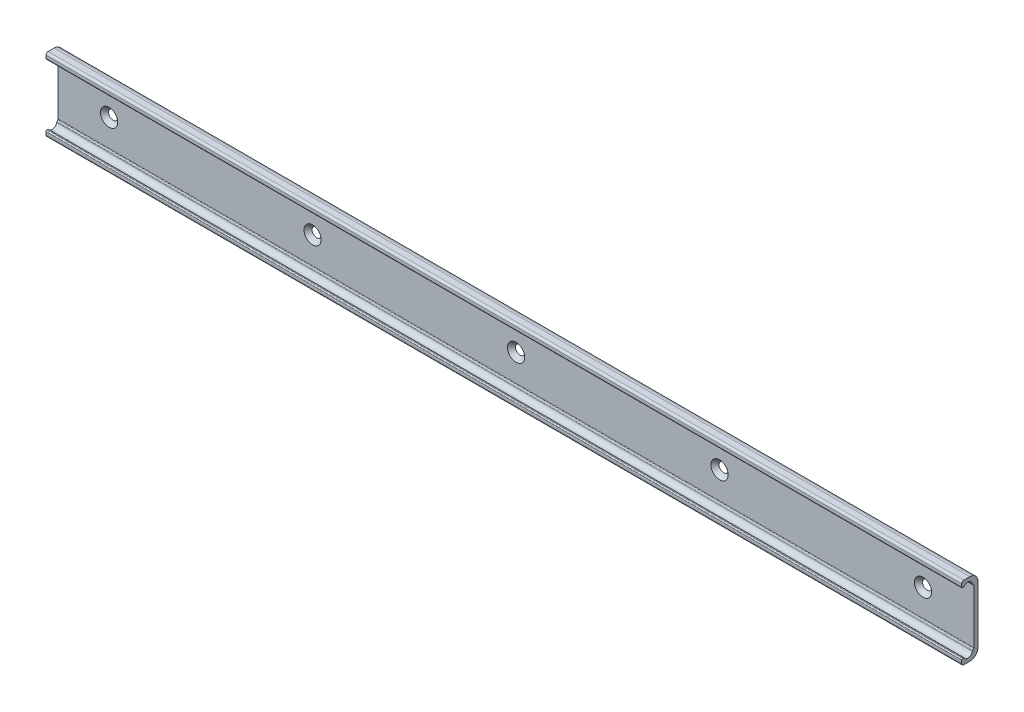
ISO-10303-21;
HEADER;
FILE_DESCRIPTION(('STEP AP214'),'2;1');
FILE_NAME('part.step','',(''),(''),'','','');
FILE_SCHEMA(('AUTOMOTIVE_DESIGN { 1 0 10303 214 1 1 1 1 }'));
ENDSEC;
DATA;
#1=APPLICATION_CONTEXT('core data for automotive mechanical design processes');
#2=APPLICATION_PROTOCOL_DEFINITION('international standard','automotive_design',2000,#1);
#3=PRODUCT_CONTEXT('',#1,'mechanical');
#4=PRODUCT('Part','Part','',(#3));
#5=PRODUCT_RELATED_PRODUCT_CATEGORY('part','',(#4));
#6=PRODUCT_DEFINITION_FORMATION('','',#4);
#7=PRODUCT_DEFINITION_CONTEXT('part definition',#1,'design');
#8=PRODUCT_DEFINITION('design','',#6,#7);
#9=PRODUCT_DEFINITION_SHAPE('','',#8);
#10=(LENGTH_UNIT() NAMED_UNIT(*) SI_UNIT(.MILLI.,.METRE.));
#11=(NAMED_UNIT(*) PLANE_ANGLE_UNIT() SI_UNIT($,.RADIAN.));
#12=(NAMED_UNIT(*) SI_UNIT($,.STERADIAN.) SOLID_ANGLE_UNIT());
#13=UNCERTAINTY_MEASURE_WITH_UNIT(LENGTH_MEASURE(1.E-05),#10,'distance_accuracy_value','');
#14=(GEOMETRIC_REPRESENTATION_CONTEXT(3) GLOBAL_UNCERTAINTY_ASSIGNED_CONTEXT((#13)) GLOBAL_UNIT_ASSIGNED_CONTEXT((#10,
#11,#12)) REPRESENTATION_CONTEXT('',''));
#15=CARTESIAN_POINT('',(0.,0.,0.));
#16=DIRECTION('',(0.,0.,1.));
#17=DIRECTION('',(1.,0.,0.));
#18=AXIS2_PLACEMENT_3D('',#15,#16,#17);
#19=CARTESIAN_POINT('',(425.,14.,4.));
#20=DIRECTION('',(-1.,0.,0.));
#21=DIRECTION('',(0.,0.,1.));
#22=AXIS2_PLACEMENT_3D('',#19,#20,#21);
#23=CYLINDRICAL_SURFACE('',#22,4.);
#24=CARTESIAN_POINT('',(-25.,14.,4.));
#25=DIRECTION('',(-1.,0.,0.));
#26=DIRECTION('',(0.,0.,1.));
#27=AXIS2_PLACEMENT_3D('',#24,#25,#26);
#28=CIRCLE('',#27,4.);
#29=CARTESIAN_POINT('',(-25.,18.,4.));
#30=VERTEX_POINT('',#29);
#31=CARTESIAN_POINT('',(-25.,14.,0.));
#32=VERTEX_POINT('',#31);
#33=EDGE_CURVE('E174',#30,#32,#28,.T.);
#34=ORIENTED_EDGE('',*,*,#33,.F.);
#35=DIRECTION('',(-1.,0.,0.));
#36=VECTOR('',#35,1.);
#37=CARTESIAN_POINT('',(425.,18.,4.));
#38=LINE('',#37,#36);
#39=CARTESIAN_POINT('',(425.,18.,4.));
#40=VERTEX_POINT('',#39);
#41=EDGE_CURVE('E9',#40,#30,#38,.T.);
#42=ORIENTED_EDGE('',*,*,#41,.F.);
#43=CARTESIAN_POINT('',(425.,14.,4.));
#44=DIRECTION('',(-1.,0.,0.));
#45=DIRECTION('',(0.,0.,1.));
#46=AXIS2_PLACEMENT_3D('',#43,#44,#45);
#47=CIRCLE('',#46,4.);
#48=CARTESIAN_POINT('',(425.,14.,0.));
#49=VERTEX_POINT('',#48);
#50=EDGE_CURVE('E176',#40,#49,#47,.T.);
#51=ORIENTED_EDGE('',*,*,#50,.T.);
#52=DIRECTION('',(-1.,0.,0.));
#53=VECTOR('',#52,1.);
#54=CARTESIAN_POINT('',(425.,14.,0.));
#55=LINE('',#54,#53);
#56=EDGE_CURVE('E17',#49,#32,#55,.T.);
#57=ORIENTED_EDGE('',*,*,#56,.T.);
#58=EDGE_LOOP('',(#34,#42,#51,#57));
#59=FACE_BOUND('',#58,.T.);
#60=ADVANCED_FACE('F14',(#59),#23,.T.);
#61=CARTESIAN_POINT('',(425.,18.,7.));
#62=DIRECTION('',(0.,1.,0.));
#63=DIRECTION('',(-1.,0.,0.));
#64=AXIS2_PLACEMENT_3D('',#61,#62,#63);
#65=PLANE('',#64);
#66=DIRECTION('',(0.,0.,-1.));
#67=VECTOR('',#66,1.);
#68=CARTESIAN_POINT('',(-25.,18.,7.));
#69=LINE('',#68,#67);
#70=CARTESIAN_POINT('',(-25.,18.,7.));
#71=VERTEX_POINT('',#70);
#72=EDGE_CURVE('E192',#71,#30,#69,.T.);
#73=ORIENTED_EDGE('',*,*,#72,.F.);
#74=DIRECTION('',(-1.,0.,0.));
#75=VECTOR('',#74,1.);
#76=CARTESIAN_POINT('',(425.,18.,7.));
#77=LINE('',#76,#75);
#78=CARTESIAN_POINT('',(425.,18.,7.));
#79=VERTEX_POINT('',#78);
#80=EDGE_CURVE('E22',#79,#71,#77,.T.);
#81=ORIENTED_EDGE('',*,*,#80,.F.);
#82=DIRECTION('',(0.,0.,-1.));
#83=VECTOR('',#82,1.);
#84=CARTESIAN_POINT('',(425.,18.,7.));
#85=LINE('',#84,#83);
#86=EDGE_CURVE('E181',#79,#40,#85,.T.);
#87=ORIENTED_EDGE('',*,*,#86,.T.);
#88=ORIENTED_EDGE('',*,*,#41,.T.);
#89=EDGE_LOOP('',(#73,#81,#87,#88));
#90=FACE_BOUND('',#89,.T.);
#91=ADVANCED_FACE('F448',(#90),#65,.T.);
#92=CARTESIAN_POINT('',(425.,17.,7.));
#93=DIRECTION('',(-1.,0.,0.));
#94=DIRECTION('',(0.,0.,1.));
#95=AXIS2_PLACEMENT_3D('',#92,#93,#94);
#96=CYLINDRICAL_SURFACE('',#95,1.);
#97=CARTESIAN_POINT('',(-25.,17.,7.));
#98=DIRECTION('',(-1.,0.,0.));
#99=DIRECTION('',(0.,0.,1.));
#100=AXIS2_PLACEMENT_3D('',#97,#98,#99);
#101=CIRCLE('',#100,1.);
#102=CARTESIAN_POINT('',(-25.,17.,8.));
#103=VERTEX_POINT('',#102);
#104=EDGE_CURVE('E258',#103,#71,#101,.T.);
#105=ORIENTED_EDGE('',*,*,#104,.F.);
#106=DIRECTION('',(-1.,0.,0.));
#107=VECTOR('',#106,1.);
#108=CARTESIAN_POINT('',(425.,17.,8.));
#109=LINE('',#108,#107);
#110=CARTESIAN_POINT('',(425.,17.,8.));
#111=VERTEX_POINT('',#110);
#112=EDGE_CURVE('E328',#111,#103,#109,.T.);
#113=ORIENTED_EDGE('',*,*,#112,.F.);
#114=CARTESIAN_POINT('',(425.,17.,7.));
#115=DIRECTION('',(-1.,0.,0.));
#116=DIRECTION('',(0.,0.,1.));
#117=AXIS2_PLACEMENT_3D('',#114,#115,#116);
#118=CIRCLE('',#117,1.);
#119=EDGE_CURVE('E324',#111,#79,#118,.T.);
#120=ORIENTED_EDGE('',*,*,#119,.T.);
#121=ORIENTED_EDGE('',*,*,#80,.T.);
#122=EDGE_LOOP('',(#105,#113,#120,#121));
#123=FACE_BOUND('',#122,.T.);
#124=ADVANCED_FACE('F453',(#123),#96,.T.);
#125=CARTESIAN_POINT('',(425.,15.55,8.));
#126=DIRECTION('',(0.,0.,1.));
#127=DIRECTION('',(1.,0.,0.));
#128=AXIS2_PLACEMENT_3D('',#125,#126,#127);
#129=PLANE('',#128);
#130=DIRECTION('',(0.,1.,0.));
#131=VECTOR('',#130,1.);
#132=CARTESIAN_POINT('',(-25.,15.55,8.));
#133=LINE('',#132,#131);
#134=CARTESIAN_POINT('',(-25.,15.55,8.));
#135=VERTEX_POINT('',#134);
#136=EDGE_CURVE('E255',#135,#103,#133,.T.);
#137=ORIENTED_EDGE('',*,*,#136,.F.);
#138=DIRECTION('',(-1.,0.,0.));
#139=VECTOR('',#138,1.);
#140=CARTESIAN_POINT('',(425.,15.55,8.));
#141=LINE('',#140,#139);
#142=CARTESIAN_POINT('',(425.,15.55,8.));
#143=VERTEX_POINT('',#142);
#144=EDGE_CURVE('E330',#143,#135,#141,.T.);
#145=ORIENTED_EDGE('',*,*,#144,.F.);
#146=DIRECTION('',(0.,1.,0.));
#147=VECTOR('',#146,1.);
#148=CARTESIAN_POINT('',(425.,15.55,8.));
#149=LINE('',#148,#147);
#150=EDGE_CURVE('E321',#143,#111,#149,.T.);
#151=ORIENTED_EDGE('',*,*,#150,.T.);
#152=ORIENTED_EDGE('',*,*,#112,.T.);
#153=EDGE_LOOP('',(#137,#145,#151,#152));
#154=FACE_BOUND('',#153,.T.);
#155=ADVANCED_FACE('F445',(#154),#129,.T.);
#156=CARTESIAN_POINT('',(425.,15.5499998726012,7.5));
#157=DIRECTION('',(-1.,0.,0.));
#158=DIRECTION('',(0.,0.,1.));
#159=AXIS2_PLACEMENT_3D('',#156,#157,#158);
#160=CYLINDRICAL_SURFACE('',#159,0.500000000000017);
#161=CARTESIAN_POINT('',(-25.,15.5499998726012,7.5));
#162=DIRECTION('',(-1.,0.,0.));
#163=DIRECTION('',(0.,0.,1.));
#164=AXIS2_PLACEMENT_3D('',#161,#162,#163);
#165=CIRCLE('',#164,0.500000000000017);
#166=CARTESIAN_POINT('',(-25.,15.0499998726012,7.49999995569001));
#167=VERTEX_POINT('',#166);
#168=EDGE_CURVE('E252',#167,#135,#165,.T.);
#169=ORIENTED_EDGE('',*,*,#168,.F.);
#170=DIRECTION('',(-1.,0.,0.));
#171=VECTOR('',#170,1.);
#172=CARTESIAN_POINT('',(425.,15.0499998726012,7.49999995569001));
#173=LINE('',#172,#171);
#174=CARTESIAN_POINT('',(425.,15.0499998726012,7.49999995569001));
#175=VERTEX_POINT('',#174);
#176=EDGE_CURVE('E332',#175,#167,#173,.T.);
#177=ORIENTED_EDGE('',*,*,#176,.F.);
#178=CARTESIAN_POINT('',(425.,15.5499998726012,7.5));
#179=DIRECTION('',(-1.,0.,0.));
#180=DIRECTION('',(0.,0.,1.));
#181=AXIS2_PLACEMENT_3D('',#178,#179,#180);
#182=CIRCLE('',#181,0.500000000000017);
#183=EDGE_CURVE('E318',#175,#143,#182,.T.);
#184=ORIENTED_EDGE('',*,*,#183,.T.);
#185=ORIENTED_EDGE('',*,*,#144,.T.);
#186=EDGE_LOOP('',(#169,#177,#184,#185));
#187=FACE_BOUND('',#186,.T.);
#188=ADVANCED_FACE('F441',(#187),#160,.T.);
#189=CARTESIAN_POINT('',(425.,15.0499998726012,7.49999995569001));
#190=DIRECTION('',(0.,-1.,0.));
#191=DIRECTION('',(1.,0.,0.));
#192=AXIS2_PLACEMENT_3D('',#189,#190,#191);
#193=PLANE('',#192);
#194=DIRECTION('',(0.,0.,1.));
#195=VECTOR('',#194,1.);
#196=CARTESIAN_POINT('',(-25.,15.0499998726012,7.49999995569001));
#197=LINE('',#196,#195);
#198=CARTESIAN_POINT('',(-25.,15.0499998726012,6.99185845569));
#199=VERTEX_POINT('',#198);
#200=EDGE_CURVE('E249',#199,#167,#197,.T.);
#201=ORIENTED_EDGE('',*,*,#200,.F.);
#202=DIRECTION('',(-1.,0.,0.));
#203=VECTOR('',#202,1.);
#204=CARTESIAN_POINT('',(425.,15.0499998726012,6.99185845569));
#205=LINE('',#204,#203);
#206=CARTESIAN_POINT('',(425.,15.0499998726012,6.99185845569));
#207=VERTEX_POINT('',#206);
#208=EDGE_CURVE('E334',#207,#199,#205,.T.);
#209=ORIENTED_EDGE('',*,*,#208,.F.);
#210=DIRECTION('',(0.,0.,1.));
#211=VECTOR('',#210,1.);
#212=CARTESIAN_POINT('',(425.,15.0499998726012,7.49999995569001));
#213=LINE('',#212,#211);
#214=EDGE_CURVE('E315',#207,#175,#213,.T.);
#215=ORIENTED_EDGE('',*,*,#214,.T.);
#216=ORIENTED_EDGE('',*,*,#176,.T.);
#217=EDGE_LOOP('',(#201,#209,#215,#216));
#218=FACE_BOUND('',#217,.T.);
#219=ADVANCED_FACE('F437',(#218),#193,.T.);
#220=CARTESIAN_POINT('',(425.,13.899999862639,4.99999993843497));
#221=DIRECTION('',(-1.,0.,0.));
#222=DIRECTION('',(0.,0.,1.));
#223=AXIS2_PLACEMENT_3D('',#220,#221,#222);
#224=CYLINDRICAL_SURFACE('',#223,2.30000008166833);
#225=CARTESIAN_POINT('',(-25.,13.899999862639,4.99999993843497));
#226=DIRECTION('',(1.,0.,0.));
#227=DIRECTION('',(0.,0.,1.));
#228=AXIS2_PLACEMENT_3D('',#225,#226,#227);
#229=CIRCLE('',#228,2.30000008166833);
#230=CARTESIAN_POINT('',(-25.,14.3822673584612,2.75112945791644));
#231=VERTEX_POINT('',#230);
#232=EDGE_CURVE('E246',#231,#199,#229,.T.);
#233=ORIENTED_EDGE('',*,*,#232,.F.);
#234=DIRECTION('',(-1.,0.,0.));
#235=VECTOR('',#234,1.);
#236=CARTESIAN_POINT('',(425.,14.3822673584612,2.75112945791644));
#237=LINE('',#236,#235);
#238=CARTESIAN_POINT('',(425.,14.3822673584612,2.75112945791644));
#239=VERTEX_POINT('',#238);
#240=EDGE_CURVE('E336',#239,#231,#237,.T.);
#241=ORIENTED_EDGE('',*,*,#240,.F.);
#242=CARTESIAN_POINT('',(425.,13.899999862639,4.99999993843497));
#243=DIRECTION('',(1.,0.,0.));
#244=DIRECTION('',(0.,0.,1.));
#245=AXIS2_PLACEMENT_3D('',#242,#243,#244);
#246=CIRCLE('',#245,2.30000008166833);
#247=EDGE_CURVE('E312',#239,#207,#246,.T.);
#248=ORIENTED_EDGE('',*,*,#247,.T.);
#249=ORIENTED_EDGE('',*,*,#208,.T.);
#250=EDGE_LOOP('',(#233,#241,#248,#249));
#251=FACE_BOUND('',#250,.T.);
#252=ADVANCED_FACE('F433',(#251),#224,.F.);
#253=CARTESIAN_POINT('',(425.,14.2647621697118,2.72240648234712));
#254=DIRECTION('',(0.,-0.237449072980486,0.971399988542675));
#255=DIRECTION('',(0.,0.971399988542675,0.237449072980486));
#256=AXIS2_PLACEMENT_3D('',#253,#254,#255);
#257=PLANE('',#256);
#258=DIRECTION('',(0.,0.971399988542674,0.237449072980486));
#259=VECTOR('',#258,1.);
#260=CARTESIAN_POINT('',(-25.,14.2647621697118,2.72240648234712));
#261=LINE('',#260,#259);
#262=CARTESIAN_POINT('',(-25.,14.2647621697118,2.72240648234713));
#263=VERTEX_POINT('',#262);
#264=EDGE_CURVE('E243',#263,#231,#261,.T.);
#265=ORIENTED_EDGE('',*,*,#264,.F.);
#266=DIRECTION('',(-1.,0.,0.));
#267=VECTOR('',#266,1.);
#268=CARTESIAN_POINT('',(425.,14.2647621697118,2.72240648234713));
#269=LINE('',#268,#267);
#270=CARTESIAN_POINT('',(425.,14.2647621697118,2.72240648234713));
#271=VERTEX_POINT('',#270);
#272=EDGE_CURVE('E338',#271,#263,#269,.T.);
#273=ORIENTED_EDGE('',*,*,#272,.F.);
#274=DIRECTION('',(0.,0.971399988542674,0.237449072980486));
#275=VECTOR('',#274,1.);
#276=CARTESIAN_POINT('',(425.,14.2647621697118,2.72240648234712));
#277=LINE('',#276,#275);
#278=EDGE_CURVE('E309',#271,#239,#277,.T.);
#279=ORIENTED_EDGE('',*,*,#278,.T.);
#280=ORIENTED_EDGE('',*,*,#240,.T.);
#281=EDGE_LOOP('',(#265,#273,#279,#280));
#282=FACE_BOUND('',#281,.T.);
#283=ADVANCED_FACE('F429',(#282),#257,.T.);
#284=CARTESIAN_POINT('',(425.,14.3343843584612,2.2272774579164));
#285=DIRECTION('',(-1.,0.,0.));
#286=DIRECTION('',(0.,0.,1.));
#287=AXIS2_PLACEMENT_3D('',#284,#285,#286);
#288=CYLINDRICAL_SURFACE('',#287,0.49999999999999);
#289=CARTESIAN_POINT('',(-25.,14.3343843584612,2.2272774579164));
#290=DIRECTION('',(-1.,0.,0.));
#291=DIRECTION('',(0.,0.,1.));
#292=AXIS2_PLACEMENT_3D('',#289,#290,#291);
#293=CIRCLE('',#292,0.49999999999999);
#294=CARTESIAN_POINT('',(-25.,13.980830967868,2.58083084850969));
#295=VERTEX_POINT('',#294);
#296=EDGE_CURVE('E240',#295,#263,#293,.T.);
#297=ORIENTED_EDGE('',*,*,#296,.F.);
#298=DIRECTION('',(-1.,0.,0.));
#299=VECTOR('',#298,1.);
#300=CARTESIAN_POINT('',(425.,13.980830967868,2.58083084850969));
#301=LINE('',#300,#299);
#302=CARTESIAN_POINT('',(425.,13.980830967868,2.58083084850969));
#303=VERTEX_POINT('',#302);
#304=EDGE_CURVE('E340',#303,#295,#301,.T.);
#305=ORIENTED_EDGE('',*,*,#304,.F.);
#306=CARTESIAN_POINT('',(425.,14.3343843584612,2.2272774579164));
#307=DIRECTION('',(-1.,0.,0.));
#308=DIRECTION('',(0.,0.,1.));
#309=AXIS2_PLACEMENT_3D('',#306,#307,#308);
#310=CIRCLE('',#309,0.49999999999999);
#311=EDGE_CURVE('E306',#303,#271,#310,.T.);
#312=ORIENTED_EDGE('',*,*,#311,.T.);
#313=ORIENTED_EDGE('',*,*,#272,.T.);
#314=EDGE_LOOP('',(#297,#305,#312,#313));
#315=FACE_BOUND('',#314,.T.);
#316=ADVANCED_FACE('F425',(#315),#288,.T.);
#317=CARTESIAN_POINT('',(425.,13.5464468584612,2.1464464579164));
#318=DIRECTION('',(0.,-0.707107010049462,0.707106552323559));
#319=DIRECTION('',(0.,0.707106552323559,0.707107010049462));
#320=AXIS2_PLACEMENT_3D('',#317,#318,#319);
#321=PLANE('',#320);
#322=DIRECTION('',(0.,0.707106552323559,0.707107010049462));
#323=VECTOR('',#322,1.);
#324=CARTESIAN_POINT('',(-25.,13.5464468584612,2.1464464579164));
#325=LINE('',#324,#323);
#326=CARTESIAN_POINT('',(-25.,13.5464468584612,2.1464464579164));
#327=VERTEX_POINT('',#326);
#328=EDGE_CURVE('E237',#327,#295,#325,.T.);
#329=ORIENTED_EDGE('',*,*,#328,.F.);
#330=DIRECTION('',(-1.,0.,0.));
#331=VECTOR('',#330,1.);
#332=CARTESIAN_POINT('',(425.,13.5464468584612,2.1464464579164));
#333=LINE('',#332,#331);
#334=CARTESIAN_POINT('',(425.,13.5464468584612,2.1464464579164));
#335=VERTEX_POINT('',#334);
#336=EDGE_CURVE('E342',#335,#327,#333,.T.);
#337=ORIENTED_EDGE('',*,*,#336,.F.);
#338=DIRECTION('',(0.,0.707106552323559,0.707107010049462));
#339=VECTOR('',#338,1.);
#340=CARTESIAN_POINT('',(425.,13.5464468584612,2.1464464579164));
#341=LINE('',#340,#339);
#342=EDGE_CURVE('E303',#335,#303,#341,.T.);
#343=ORIENTED_EDGE('',*,*,#342,.T.);
#344=ORIENTED_EDGE('',*,*,#304,.T.);
#345=EDGE_LOOP('',(#329,#337,#343,#344));
#346=FACE_BOUND('',#345,.T.);
#347=ADVANCED_FACE('F421',(#346),#321,.T.);
#348=CARTESIAN_POINT('',(425.,13.1928934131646,2.49999990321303));
#349=DIRECTION('',(-1.,0.,0.));
#350=DIRECTION('',(0.,0.,1.));
#351=AXIS2_PLACEMENT_3D('',#348,#349,#350);
#352=CYLINDRICAL_SURFACE('',#351,0.500000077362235);
#353=CARTESIAN_POINT('',(-25.,13.1928934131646,2.49999990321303));
#354=DIRECTION('',(1.,0.,0.));
#355=DIRECTION('',(0.,0.,1.));
#356=AXIS2_PLACEMENT_3D('',#353,#354,#355);
#357=CIRCLE('',#356,0.500000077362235);
#358=CARTESIAN_POINT('',(-25.,13.1928934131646,1.9999998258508));
#359=VERTEX_POINT('',#358);
#360=EDGE_CURVE('E234',#359,#327,#357,.T.);
#361=ORIENTED_EDGE('',*,*,#360,.F.);
#362=DIRECTION('',(-1.,0.,0.));
#363=VECTOR('',#362,1.);
#364=CARTESIAN_POINT('',(425.,13.1928934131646,1.9999998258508));
#365=LINE('',#364,#363);
#366=CARTESIAN_POINT('',(425.,13.1928934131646,1.9999998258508));
#367=VERTEX_POINT('',#366);
#368=EDGE_CURVE('E344',#367,#359,#365,.T.);
#369=ORIENTED_EDGE('',*,*,#368,.F.);
#370=CARTESIAN_POINT('',(425.,13.1928934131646,2.49999990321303));
#371=DIRECTION('',(1.,0.,0.));
#372=DIRECTION('',(0.,0.,1.));
#373=AXIS2_PLACEMENT_3D('',#370,#371,#372);
#374=CIRCLE('',#373,0.500000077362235);
#375=EDGE_CURVE('E300',#367,#335,#374,.T.);
#376=ORIENTED_EDGE('',*,*,#375,.T.);
#377=ORIENTED_EDGE('',*,*,#336,.T.);
#378=EDGE_LOOP('',(#361,#369,#376,#377));
#379=FACE_BOUND('',#378,.T.);
#380=ADVANCED_FACE('F417',(#379),#352,.F.);
#381=CARTESIAN_POINT('',(425.,-13.1928934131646,1.9999998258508));
#382=DIRECTION('',(0.,0.,1.));
#383=DIRECTION('',(0.,1.,0.));
#384=AXIS2_PLACEMENT_3D('',#381,#382,#383);
#385=PLANE('',#384);
#386=CARTESIAN_POINT('',(400.,0.,1.9999998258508));
#387=DIRECTION('',(0.,0.,1.));
#388=DIRECTION('',(0.,1.,0.));
#389=AXIS2_PLACEMENT_3D('',#386,#387,#388);
#390=CIRCLE('',#389,4.25);
#391=CARTESIAN_POINT('',(400.,4.25,1.99999982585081));
#392=VERTEX_POINT('',#391);
#393=EDGE_CURVE('E722',#392,#392,#390,.T.);
#394=ORIENTED_EDGE('',*,*,#393,.F.);
#395=EDGE_LOOP('',(#394));
#396=FACE_BOUND('',#395,.T.);
#397=CARTESIAN_POINT('',(300.,0.,1.9999998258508));
#398=DIRECTION('',(0.,0.,1.));
#399=DIRECTION('',(0.,1.,0.));
#400=AXIS2_PLACEMENT_3D('',#397,#398,#399);
#401=CIRCLE('',#400,4.25);
#402=CARTESIAN_POINT('',(300.,4.25,1.99999982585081));
#403=VERTEX_POINT('',#402);
#404=EDGE_CURVE('E726',#403,#403,#401,.T.);
#405=ORIENTED_EDGE('',*,*,#404,.F.);
#406=EDGE_LOOP('',(#405));
#407=FACE_BOUND('',#406,.T.);
#408=CARTESIAN_POINT('',(200.,0.,1.9999998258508));
#409=DIRECTION('',(0.,0.,1.));
#410=DIRECTION('',(0.,1.,0.));
#411=AXIS2_PLACEMENT_3D('',#408,#409,#410);
#412=CIRCLE('',#411,4.25);
#413=CARTESIAN_POINT('',(200.,4.25,1.99999982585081));
#414=VERTEX_POINT('',#413);
#415=EDGE_CURVE('E735',#414,#414,#412,.T.);
#416=ORIENTED_EDGE('',*,*,#415,.F.);
#417=EDGE_LOOP('',(#416));
#418=FACE_BOUND('',#417,.T.);
#419=CARTESIAN_POINT('',(100.,0.,1.9999998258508));
#420=DIRECTION('',(0.,0.,1.));
#421=DIRECTION('',(0.,1.,0.));
#422=AXIS2_PLACEMENT_3D('',#419,#420,#421);
#423=CIRCLE('',#422,4.25);
#424=CARTESIAN_POINT('',(100.,4.25,1.99999982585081));
#425=VERTEX_POINT('',#424);
#426=EDGE_CURVE('E741',#425,#425,#423,.T.);
#427=ORIENTED_EDGE('',*,*,#426,.F.);
#428=EDGE_LOOP('',(#427));
#429=FACE_BOUND('',#428,.T.);
#430=CARTESIAN_POINT('',(0.,0.,1.9999998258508));
#431=DIRECTION('',(0.,0.,1.));
#432=DIRECTION('',(0.,1.,0.));
#433=AXIS2_PLACEMENT_3D('',#430,#431,#432);
#434=CIRCLE('',#433,4.25);
#435=CARTESIAN_POINT('',(0.,4.25,1.99999982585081));
#436=VERTEX_POINT('',#435);
#437=EDGE_CURVE('E196',#436,#436,#434,.T.);
#438=ORIENTED_EDGE('',*,*,#437,.F.);
#439=EDGE_LOOP('',(#438));
#440=FACE_BOUND('',#439,.T.);
#441=DIRECTION('',(0.,1.,0.));
#442=VECTOR('',#441,1.);
#443=CARTESIAN_POINT('',(-25.,-13.1928934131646,1.9999998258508));
#444=LINE('',#443,#442);
#445=CARTESIAN_POINT('',(-25.,-13.1928934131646,1.9999998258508));
#446=VERTEX_POINT('',#445);
#447=EDGE_CURVE('E231',#446,#359,#444,.T.);
#448=ORIENTED_EDGE('',*,*,#447,.F.);
#449=DIRECTION('',(-1.,0.,0.));
#450=VECTOR('',#449,1.);
#451=CARTESIAN_POINT('',(425.,-13.1928934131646,1.9999998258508));
#452=LINE('',#451,#450);
#453=CARTESIAN_POINT('',(425.,-13.1928934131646,1.9999998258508));
#454=VERTEX_POINT('',#453);
#455=EDGE_CURVE('E346',#454,#446,#452,.T.);
#456=ORIENTED_EDGE('',*,*,#455,.F.);
#457=DIRECTION('',(0.,1.,0.));
#458=VECTOR('',#457,1.);
#459=CARTESIAN_POINT('',(425.,-13.1928934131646,1.9999998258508));
#460=LINE('',#459,#458);
#461=EDGE_CURVE('E297',#454,#367,#460,.T.);
#462=ORIENTED_EDGE('',*,*,#461,.T.);
#463=ORIENTED_EDGE('',*,*,#368,.T.);
#464=EDGE_LOOP('',(#448,#456,#462,#463));
#465=FACE_BOUND('',#464,.T.);
#466=ADVANCED_FACE('F413',(#396,#407,#418,#429,#440,#465),#385,.T.);
#467=CARTESIAN_POINT('',(425.,-13.1928934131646,2.49999990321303));
#468=DIRECTION('',(-1.,0.,0.));
#469=DIRECTION('',(0.,0.,1.));
#470=AXIS2_PLACEMENT_3D('',#467,#468,#469);
#471=CYLINDRICAL_SURFACE('',#470,0.500000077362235);
#472=CARTESIAN_POINT('',(-25.,-13.1928934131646,2.49999990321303));
#473=DIRECTION('',(1.,0.,0.));
#474=DIRECTION('',(0.,0.,-1.));
#475=AXIS2_PLACEMENT_3D('',#472,#473,#474);
#476=CIRCLE('',#475,0.500000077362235);
#477=CARTESIAN_POINT('',(-25.,-13.5464468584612,2.1464464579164));
#478=VERTEX_POINT('',#477);
#479=EDGE_CURVE('E228',#478,#446,#476,.T.);
#480=ORIENTED_EDGE('',*,*,#479,.F.);
#481=DIRECTION('',(-1.,0.,0.));
#482=VECTOR('',#481,1.);
#483=CARTESIAN_POINT('',(425.,-13.5464468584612,2.1464464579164));
#484=LINE('',#483,#482);
#485=CARTESIAN_POINT('',(425.,-13.5464468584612,2.1464464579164));
#486=VERTEX_POINT('',#485);
#487=EDGE_CURVE('E348',#486,#478,#484,.T.);
#488=ORIENTED_EDGE('',*,*,#487,.F.);
#489=CARTESIAN_POINT('',(425.,-13.1928934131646,2.49999990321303));
#490=DIRECTION('',(1.,0.,0.));
#491=DIRECTION('',(0.,0.,-1.));
#492=AXIS2_PLACEMENT_3D('',#489,#490,#491);
#493=CIRCLE('',#492,0.500000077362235);
#494=EDGE_CURVE('E294',#486,#454,#493,.T.);
#495=ORIENTED_EDGE('',*,*,#494,.T.);
#496=ORIENTED_EDGE('',*,*,#455,.T.);
#497=EDGE_LOOP('',(#480,#488,#495,#496));
#498=FACE_BOUND('',#497,.T.);
#499=ADVANCED_FACE('F409',(#498),#471,.F.);
#500=CARTESIAN_POINT('',(425.,-13.5464468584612,2.1464464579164));
#501=DIRECTION('',(0.,0.707107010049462,0.707106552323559));
#502=DIRECTION('',(0.,0.707106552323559,-0.707107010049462));
#503=AXIS2_PLACEMENT_3D('',#500,#501,#502);
#504=PLANE('',#503);
#505=DIRECTION('',(0.,0.707106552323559,-0.707107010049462));
#506=VECTOR('',#505,1.);
#507=CARTESIAN_POINT('',(-25.,-13.5464468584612,2.1464464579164));
#508=LINE('',#507,#506);
#509=CARTESIAN_POINT('',(-25.,-13.980830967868,2.58083084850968));
#510=VERTEX_POINT('',#509);
#511=EDGE_CURVE('E225',#510,#478,#508,.T.);
#512=ORIENTED_EDGE('',*,*,#511,.F.);
#513=DIRECTION('',(-1.,0.,0.));
#514=VECTOR('',#513,1.);
#515=CARTESIAN_POINT('',(425.,-13.980830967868,2.58083084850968));
#516=LINE('',#515,#514);
#517=CARTESIAN_POINT('',(425.,-13.980830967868,2.58083084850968));
#518=VERTEX_POINT('',#517);
#519=EDGE_CURVE('E350',#518,#510,#516,.T.);
#520=ORIENTED_EDGE('',*,*,#519,.F.);
#521=DIRECTION('',(0.,0.707106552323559,-0.707107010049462));
#522=VECTOR('',#521,1.);
#523=CARTESIAN_POINT('',(425.,-13.5464468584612,2.1464464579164));
#524=LINE('',#523,#522);
#525=EDGE_CURVE('E291',#518,#486,#524,.T.);
#526=ORIENTED_EDGE('',*,*,#525,.T.);
#527=ORIENTED_EDGE('',*,*,#487,.T.);
#528=EDGE_LOOP('',(#512,#520,#526,#527));
#529=FACE_BOUND('',#528,.T.);
#530=ADVANCED_FACE('F405',(#529),#504,.T.);
#531=CARTESIAN_POINT('',(425.,-14.3343843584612,2.22727745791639));
#532=DIRECTION('',(-1.,0.,0.));
#533=DIRECTION('',(0.,0.,1.));
#534=AXIS2_PLACEMENT_3D('',#531,#532,#533);
#535=CYLINDRICAL_SURFACE('',#534,0.49999999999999);
#536=CARTESIAN_POINT('',(-25.,-14.3343843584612,2.22727745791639));
#537=DIRECTION('',(-1.,0.,0.));
#538=DIRECTION('',(0.,0.,-1.));
#539=AXIS2_PLACEMENT_3D('',#536,#537,#538);
#540=CIRCLE('',#539,0.49999999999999);
#541=CARTESIAN_POINT('',(-25.,-14.2647621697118,2.72240648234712));
#542=VERTEX_POINT('',#541);
#543=EDGE_CURVE('E222',#542,#510,#540,.T.);
#544=ORIENTED_EDGE('',*,*,#543,.F.);
#545=DIRECTION('',(-1.,0.,0.));
#546=VECTOR('',#545,1.);
#547=CARTESIAN_POINT('',(425.,-14.2647621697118,2.72240648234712));
#548=LINE('',#547,#546);
#549=CARTESIAN_POINT('',(425.,-14.2647621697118,2.72240648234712));
#550=VERTEX_POINT('',#549);
#551=EDGE_CURVE('E352',#550,#542,#548,.T.);
#552=ORIENTED_EDGE('',*,*,#551,.F.);
#553=CARTESIAN_POINT('',(425.,-14.3343843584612,2.22727745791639));
#554=DIRECTION('',(-1.,0.,0.));
#555=DIRECTION('',(0.,0.,-1.));
#556=AXIS2_PLACEMENT_3D('',#553,#554,#555);
#557=CIRCLE('',#556,0.49999999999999);
#558=EDGE_CURVE('E288',#550,#518,#557,.T.);
#559=ORIENTED_EDGE('',*,*,#558,.T.);
#560=ORIENTED_EDGE('',*,*,#519,.T.);
#561=EDGE_LOOP('',(#544,#552,#559,#560));
#562=FACE_BOUND('',#561,.T.);
#563=ADVANCED_FACE('F401',(#562),#535,.T.);
#564=CARTESIAN_POINT('',(425.,-14.2647621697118,2.72240648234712));
#565=DIRECTION('',(0.,0.237449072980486,0.971399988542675));
#566=DIRECTION('',(0.,0.971399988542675,-0.237449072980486));
#567=AXIS2_PLACEMENT_3D('',#564,#565,#566);
#568=PLANE('',#567);
#569=DIRECTION('',(0.,0.971399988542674,-0.237449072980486));
#570=VECTOR('',#569,1.);
#571=CARTESIAN_POINT('',(-25.,-14.2647621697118,2.72240648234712));
#572=LINE('',#571,#570);
#573=CARTESIAN_POINT('',(-25.,-14.3822673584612,2.75112945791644));
#574=VERTEX_POINT('',#573);
#575=EDGE_CURVE('E219',#574,#542,#572,.T.);
#576=ORIENTED_EDGE('',*,*,#575,.F.);
#577=DIRECTION('',(-1.,0.,0.));
#578=VECTOR('',#577,1.);
#579=CARTESIAN_POINT('',(425.,-14.3822673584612,2.75112945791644));
#580=LINE('',#579,#578);
#581=CARTESIAN_POINT('',(425.,-14.3822673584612,2.75112945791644));
#582=VERTEX_POINT('',#581);
#583=EDGE_CURVE('E354',#582,#574,#580,.T.);
#584=ORIENTED_EDGE('',*,*,#583,.F.);
#585=DIRECTION('',(0.,0.971399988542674,-0.237449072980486));
#586=VECTOR('',#585,1.);
#587=CARTESIAN_POINT('',(425.,-14.2647621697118,2.72240648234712));
#588=LINE('',#587,#586);
#589=EDGE_CURVE('E285',#582,#550,#588,.T.);
#590=ORIENTED_EDGE('',*,*,#589,.T.);
#591=ORIENTED_EDGE('',*,*,#551,.T.);
#592=EDGE_LOOP('',(#576,#584,#590,#591));
#593=FACE_BOUND('',#592,.T.);
#594=ADVANCED_FACE('F397',(#593),#568,.T.);
#595=CARTESIAN_POINT('',(425.,-13.899999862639,4.99999993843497));
#596=DIRECTION('',(-1.,0.,0.));
#597=DIRECTION('',(0.,0.,1.));
#598=AXIS2_PLACEMENT_3D('',#595,#596,#597);
#599=CYLINDRICAL_SURFACE('',#598,2.30000008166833);
#600=CARTESIAN_POINT('',(-25.,-13.899999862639,4.99999993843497));
#601=DIRECTION('',(1.,0.,0.));
#602=DIRECTION('',(0.,0.,-1.));
#603=AXIS2_PLACEMENT_3D('',#600,#601,#602);
#604=CIRCLE('',#603,2.30000008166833);
#605=CARTESIAN_POINT('',(-25.,-15.0499998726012,6.99185845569));
#606=VERTEX_POINT('',#605);
#607=EDGE_CURVE('E216',#606,#574,#604,.T.);
#608=ORIENTED_EDGE('',*,*,#607,.F.);
#609=DIRECTION('',(-1.,0.,0.));
#610=VECTOR('',#609,1.);
#611=CARTESIAN_POINT('',(425.,-15.0499998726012,6.99185845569));
#612=LINE('',#611,#610);
#613=CARTESIAN_POINT('',(425.,-15.0499998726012,6.99185845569));
#614=VERTEX_POINT('',#613);
#615=EDGE_CURVE('E356',#614,#606,#612,.T.);
#616=ORIENTED_EDGE('',*,*,#615,.F.);
#617=CARTESIAN_POINT('',(425.,-13.899999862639,4.99999993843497));
#618=DIRECTION('',(1.,0.,0.));
#619=DIRECTION('',(0.,0.,-1.));
#620=AXIS2_PLACEMENT_3D('',#617,#618,#619);
#621=CIRCLE('',#620,2.30000008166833);
#622=EDGE_CURVE('E282',#614,#582,#621,.T.);
#623=ORIENTED_EDGE('',*,*,#622,.T.);
#624=ORIENTED_EDGE('',*,*,#583,.T.);
#625=EDGE_LOOP('',(#608,#616,#623,#624));
#626=FACE_BOUND('',#625,.T.);
#627=ADVANCED_FACE('F393',(#626),#599,.F.);
#628=CARTESIAN_POINT('',(425.,-15.0499998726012,7.49999995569));
#629=DIRECTION('',(0.,1.,0.));
#630=DIRECTION('',(-1.,0.,0.));
#631=AXIS2_PLACEMENT_3D('',#628,#629,#630);
#632=PLANE('',#631);
#633=DIRECTION('',(0.,0.,-1.));
#634=VECTOR('',#633,1.);
#635=CARTESIAN_POINT('',(-25.,-15.0499998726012,7.49999995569));
#636=LINE('',#635,#634);
#637=CARTESIAN_POINT('',(-25.,-15.0499998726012,7.49999995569));
#638=VERTEX_POINT('',#637);
#639=EDGE_CURVE('E213',#638,#606,#636,.T.);
#640=ORIENTED_EDGE('',*,*,#639,.F.);
#641=DIRECTION('',(-1.,0.,0.));
#642=VECTOR('',#641,1.);
#643=CARTESIAN_POINT('',(425.,-15.0499998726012,7.49999995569));
#644=LINE('',#643,#642);
#645=CARTESIAN_POINT('',(425.,-15.0499998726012,7.49999995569));
#646=VERTEX_POINT('',#645);
#647=EDGE_CURVE('E358',#646,#638,#644,.T.);
#648=ORIENTED_EDGE('',*,*,#647,.F.);
#649=DIRECTION('',(0.,0.,-1.));
#650=VECTOR('',#649,1.);
#651=CARTESIAN_POINT('',(425.,-15.0499998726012,7.49999995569));
#652=LINE('',#651,#650);
#653=EDGE_CURVE('E279',#646,#614,#652,.T.);
#654=ORIENTED_EDGE('',*,*,#653,.T.);
#655=ORIENTED_EDGE('',*,*,#615,.T.);
#656=EDGE_LOOP('',(#640,#648,#654,#655));
#657=FACE_BOUND('',#656,.T.);
#658=ADVANCED_FACE('F389',(#657),#632,.T.);
#659=CARTESIAN_POINT('',(425.,-15.5499998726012,7.5));
#660=DIRECTION('',(-1.,0.,0.));
#661=DIRECTION('',(0.,0.,1.));
#662=AXIS2_PLACEMENT_3D('',#659,#660,#661);
#663=CYLINDRICAL_SURFACE('',#662,0.500000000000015);
#664=CARTESIAN_POINT('',(-25.,-15.5499998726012,7.5));
#665=DIRECTION('',(-1.,0.,0.));
#666=DIRECTION('',(0.,0.,-1.));
#667=AXIS2_PLACEMENT_3D('',#664,#665,#666);
#668=CIRCLE('',#667,0.500000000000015);
#669=CARTESIAN_POINT('',(-25.,-15.55,8.));
#670=VERTEX_POINT('',#669);
#671=EDGE_CURVE('E210',#670,#638,#668,.T.);
#672=ORIENTED_EDGE('',*,*,#671,.F.);
#673=DIRECTION('',(-1.,0.,0.));
#674=VECTOR('',#673,1.);
#675=CARTESIAN_POINT('',(425.,-15.55,8.));
#676=LINE('',#675,#674);
#677=CARTESIAN_POINT('',(425.,-15.55,8.));
#678=VERTEX_POINT('',#677);
#679=EDGE_CURVE('E360',#678,#670,#676,.T.);
#680=ORIENTED_EDGE('',*,*,#679,.F.);
#681=CARTESIAN_POINT('',(425.,-15.5499998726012,7.5));
#682=DIRECTION('',(-1.,0.,0.));
#683=DIRECTION('',(0.,0.,-1.));
#684=AXIS2_PLACEMENT_3D('',#681,#682,#683);
#685=CIRCLE('',#684,0.500000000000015);
#686=EDGE_CURVE('E276',#678,#646,#685,.T.);
#687=ORIENTED_EDGE('',*,*,#686,.T.);
#688=ORIENTED_EDGE('',*,*,#647,.T.);
#689=EDGE_LOOP('',(#672,#680,#687,#688));
#690=FACE_BOUND('',#689,.T.);
#691=ADVANCED_FACE('F385',(#690),#663,.T.);
#692=CARTESIAN_POINT('',(425.,-15.55,8.));
#693=DIRECTION('',(0.,0.,1.));
#694=DIRECTION('',(1.,0.,0.));
#695=AXIS2_PLACEMENT_3D('',#692,#693,#694);
#696=PLANE('',#695);
#697=DIRECTION('',(0.,1.,0.));
#698=VECTOR('',#697,1.);
#699=CARTESIAN_POINT('',(-25.,-15.55,8.));
#700=LINE('',#699,#698);
#701=CARTESIAN_POINT('',(-25.,-17.,8.));
#702=VERTEX_POINT('',#701);
#703=EDGE_CURVE('E207',#702,#670,#700,.T.);
#704=ORIENTED_EDGE('',*,*,#703,.F.);
#705=DIRECTION('',(-1.,0.,0.));
#706=VECTOR('',#705,1.);
#707=CARTESIAN_POINT('',(425.,-17.,8.));
#708=LINE('',#707,#706);
#709=CARTESIAN_POINT('',(425.,-17.,8.));
#710=VERTEX_POINT('',#709);
#711=EDGE_CURVE('E362',#710,#702,#708,.T.);
#712=ORIENTED_EDGE('',*,*,#711,.F.);
#713=DIRECTION('',(0.,1.,0.));
#714=VECTOR('',#713,1.);
#715=CARTESIAN_POINT('',(425.,-15.55,8.));
#716=LINE('',#715,#714);
#717=EDGE_CURVE('E273',#710,#678,#716,.T.);
#718=ORIENTED_EDGE('',*,*,#717,.T.);
#719=ORIENTED_EDGE('',*,*,#679,.T.);
#720=EDGE_LOOP('',(#704,#712,#718,#719));
#721=FACE_BOUND('',#720,.T.);
#722=ADVANCED_FACE('F381',(#721),#696,.T.);
#723=CARTESIAN_POINT('',(425.,-17.,7.));
#724=DIRECTION('',(-1.,0.,0.));
#725=DIRECTION('',(0.,0.,1.));
#726=AXIS2_PLACEMENT_3D('',#723,#724,#725);
#727=CYLINDRICAL_SURFACE('',#726,1.);
#728=CARTESIAN_POINT('',(-25.,-17.,7.));
#729=DIRECTION('',(-1.,0.,0.));
#730=DIRECTION('',(0.,0.,-1.));
#731=AXIS2_PLACEMENT_3D('',#728,#729,#730);
#732=CIRCLE('',#731,1.);
#733=CARTESIAN_POINT('',(-25.,-18.,7.));
#734=VERTEX_POINT('',#733);
#735=EDGE_CURVE('E204',#734,#702,#732,.T.);
#736=ORIENTED_EDGE('',*,*,#735,.F.);
#737=DIRECTION('',(-1.,0.,0.));
#738=VECTOR('',#737,1.);
#739=CARTESIAN_POINT('',(425.,-18.,7.));
#740=LINE('',#739,#738);
#741=CARTESIAN_POINT('',(425.,-18.,7.));
#742=VERTEX_POINT('',#741);
#743=EDGE_CURVE('E364',#742,#734,#740,.T.);
#744=ORIENTED_EDGE('',*,*,#743,.F.);
#745=CARTESIAN_POINT('',(425.,-17.,7.));
#746=DIRECTION('',(-1.,0.,0.));
#747=DIRECTION('',(0.,0.,-1.));
#748=AXIS2_PLACEMENT_3D('',#745,#746,#747);
#749=CIRCLE('',#748,1.);
#750=EDGE_CURVE('E270',#742,#710,#749,.T.);
#751=ORIENTED_EDGE('',*,*,#750,.T.);
#752=ORIENTED_EDGE('',*,*,#711,.T.);
#753=EDGE_LOOP('',(#736,#744,#751,#752));
#754=FACE_BOUND('',#753,.T.);
#755=ADVANCED_FACE('F377',(#754),#727,.T.);
#756=CARTESIAN_POINT('',(425.,-18.,7.));
#757=DIRECTION('',(0.,-1.,0.));
#758=DIRECTION('',(1.,0.,0.));
#759=AXIS2_PLACEMENT_3D('',#756,#757,#758);
#760=PLANE('',#759);
#761=DIRECTION('',(0.,0.,1.));
#762=VECTOR('',#761,1.);
#763=CARTESIAN_POINT('',(-25.,-18.,7.));
#764=LINE('',#763,#762);
#765=CARTESIAN_POINT('',(-25.,-18.,4.));
#766=VERTEX_POINT('',#765);
#767=EDGE_CURVE('E201',#766,#734,#764,.T.);
#768=ORIENTED_EDGE('',*,*,#767,.F.);
#769=DIRECTION('',(-1.,0.,0.));
#770=VECTOR('',#769,1.);
#771=CARTESIAN_POINT('',(425.,-18.,4.));
#772=LINE('',#771,#770);
#773=CARTESIAN_POINT('',(425.,-18.,4.));
#774=VERTEX_POINT('',#773);
#775=EDGE_CURVE('E366',#774,#766,#772,.T.);
#776=ORIENTED_EDGE('',*,*,#775,.F.);
#777=DIRECTION('',(0.,0.,1.));
#778=VECTOR('',#777,1.);
#779=CARTESIAN_POINT('',(425.,-18.,7.));
#780=LINE('',#779,#778);
#781=EDGE_CURVE('E267',#774,#742,#780,.T.);
#782=ORIENTED_EDGE('',*,*,#781,.T.);
#783=ORIENTED_EDGE('',*,*,#743,.T.);
#784=EDGE_LOOP('',(#768,#776,#782,#783));
#785=FACE_BOUND('',#784,.T.);
#786=ADVANCED_FACE('F373',(#785),#760,.T.);
#787=CARTESIAN_POINT('',(425.,-14.,4.));
#788=DIRECTION('',(-1.,0.,0.));
#789=DIRECTION('',(0.,0.,1.));
#790=AXIS2_PLACEMENT_3D('',#787,#788,#789);
#791=CYLINDRICAL_SURFACE('',#790,4.);
#792=CARTESIAN_POINT('',(-25.,-14.,4.));
#793=DIRECTION('',(-1.,0.,0.));
#794=DIRECTION('',(0.,0.,-1.));
#795=AXIS2_PLACEMENT_3D('',#792,#793,#794);
#796=CIRCLE('',#795,4.);
#797=CARTESIAN_POINT('',(-25.,-14.,0.));
#798=VERTEX_POINT('',#797);
#799=EDGE_CURVE('E188',#798,#766,#796,.T.);
#800=ORIENTED_EDGE('',*,*,#799,.F.);
#801=DIRECTION('',(-1.,0.,0.));
#802=VECTOR('',#801,1.);
#803=CARTESIAN_POINT('',(425.,-14.,0.));
#804=LINE('',#803,#802);
#805=CARTESIAN_POINT('',(425.,-14.,0.));
#806=VERTEX_POINT('',#805);
#807=EDGE_CURVE('E180',#806,#798,#804,.T.);
#808=ORIENTED_EDGE('',*,*,#807,.F.);
#809=CARTESIAN_POINT('',(425.,-14.,4.));
#810=DIRECTION('',(-1.,0.,0.));
#811=DIRECTION('',(0.,0.,-1.));
#812=AXIS2_PLACEMENT_3D('',#809,#810,#811);
#813=CIRCLE('',#812,4.);
#814=EDGE_CURVE('E264',#806,#774,#813,.T.);
#815=ORIENTED_EDGE('',*,*,#814,.T.);
#816=ORIENTED_EDGE('',*,*,#775,.T.);
#817=EDGE_LOOP('',(#800,#808,#815,#816));
#818=FACE_BOUND('',#817,.T.);
#819=ADVANCED_FACE('F369',(#818),#791,.T.);
#820=CARTESIAN_POINT('',(425.,-14.,0.));
#821=DIRECTION('',(0.,0.,-1.));
#822=DIRECTION('',(-1.,0.,0.));
#823=AXIS2_PLACEMENT_3D('',#820,#821,#822);
#824=PLANE('',#823);
#825=CARTESIAN_POINT('',(400.,0.,-1.74149182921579E-07));
#826=DIRECTION('',(0.,0.,1.));
#827=DIRECTION('',(0.,1.,0.));
#828=AXIS2_PLACEMENT_3D('',#825,#826,#827);
#829=CIRCLE('',#828,2.25);
#830=CARTESIAN_POINT('',(400.,2.25,-1.74149182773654E-07));
#831=VERTEX_POINT('',#830);
#832=EDGE_CURVE('E725',#831,#831,#829,.T.);
#833=ORIENTED_EDGE('',*,*,#832,.T.);
#834=EDGE_LOOP('',(#833));
#835=FACE_BOUND('',#834,.T.);
#836=CARTESIAN_POINT('',(300.,0.,-1.74149182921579E-07));
#837=DIRECTION('',(0.,0.,1.));
#838=DIRECTION('',(0.,1.,0.));
#839=AXIS2_PLACEMENT_3D('',#836,#837,#838);
#840=CIRCLE('',#839,2.25);
#841=CARTESIAN_POINT('',(300.,2.25,-1.74149182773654E-07));
#842=VERTEX_POINT('',#841);
#843=EDGE_CURVE('E729',#842,#842,#840,.T.);
#844=ORIENTED_EDGE('',*,*,#843,.T.);
#845=EDGE_LOOP('',(#844));
#846=FACE_BOUND('',#845,.T.);
#847=CARTESIAN_POINT('',(200.,0.,-1.74149182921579E-07));
#848=DIRECTION('',(0.,0.,1.));
#849=DIRECTION('',(0.,1.,0.));
#850=AXIS2_PLACEMENT_3D('',#847,#848,#849);
#851=CIRCLE('',#850,2.25);
#852=CARTESIAN_POINT('',(200.,2.25,-1.74149182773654E-07));
#853=VERTEX_POINT('',#852);
#854=EDGE_CURVE('E738',#853,#853,#851,.T.);
#855=ORIENTED_EDGE('',*,*,#854,.T.);
#856=EDGE_LOOP('',(#855));
#857=FACE_BOUND('',#856,.T.);
#858=CARTESIAN_POINT('',(100.,0.,-1.74149182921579E-07));
#859=DIRECTION('',(0.,0.,1.));
#860=DIRECTION('',(0.,1.,0.));
#861=AXIS2_PLACEMENT_3D('',#858,#859,#860);
#862=CIRCLE('',#861,2.25);
#863=CARTESIAN_POINT('',(100.,2.25,-1.74149182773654E-07));
#864=VERTEX_POINT('',#863);
#865=EDGE_CURVE('E744',#864,#864,#862,.T.);
#866=ORIENTED_EDGE('',*,*,#865,.T.);
#867=EDGE_LOOP('',(#866));
#868=FACE_BOUND('',#867,.T.);
#869=CARTESIAN_POINT('',(0.,0.,-1.74149182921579E-07));
#870=DIRECTION('',(0.,0.,1.));
#871=DIRECTION('',(0.,1.,0.));
#872=AXIS2_PLACEMENT_3D('',#869,#870,#871);
#873=CIRCLE('',#872,2.25);
#874=CARTESIAN_POINT('',(0.,2.25,-1.74149182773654E-07));
#875=VERTEX_POINT('',#874);
#876=EDGE_CURVE('E193',#875,#875,#873,.T.);
#877=ORIENTED_EDGE('',*,*,#876,.T.);
#878=EDGE_LOOP('',(#877));
#879=FACE_BOUND('',#878,.T.);
#880=DIRECTION('',(0.,-1.,0.));
#881=VECTOR('',#880,1.);
#882=CARTESIAN_POINT('',(-25.,-14.,0.));
#883=LINE('',#882,#881);
#884=EDGE_CURVE('E183',#32,#798,#883,.T.);
#885=ORIENTED_EDGE('',*,*,#884,.F.);
#886=ORIENTED_EDGE('',*,*,#56,.F.);
#887=DIRECTION('',(0.,-1.,0.));
#888=VECTOR('',#887,1.);
#889=CARTESIAN_POINT('',(425.,-14.,0.));
#890=LINE('',#889,#888);
#891=EDGE_CURVE('E262',#49,#806,#890,.T.);
#892=ORIENTED_EDGE('',*,*,#891,.T.);
#893=ORIENTED_EDGE('',*,*,#807,.T.);
#894=EDGE_LOOP('',(#885,#886,#892,#893));
#895=FACE_BOUND('',#894,.T.);
#896=ADVANCED_FACE('F184',(#835,#846,#857,#868,#879,#895),#824,.T.);
#897=CARTESIAN_POINT('',(425.,14.,4.));
#898=DIRECTION('',(-1.,0.,0.));
#899=DIRECTION('',(0.,0.,1.));
#900=AXIS2_PLACEMENT_3D('',#897,#898,#899);
#901=PLANE('',#900);
#902=ORIENTED_EDGE('',*,*,#50,.F.);
#903=ORIENTED_EDGE('',*,*,#86,.F.);
#904=ORIENTED_EDGE('',*,*,#119,.F.);
#905=ORIENTED_EDGE('',*,*,#150,.F.);
#906=ORIENTED_EDGE('',*,*,#183,.F.);
#907=ORIENTED_EDGE('',*,*,#214,.F.);
#908=ORIENTED_EDGE('',*,*,#247,.F.);
#909=ORIENTED_EDGE('',*,*,#278,.F.);
#910=ORIENTED_EDGE('',*,*,#311,.F.);
#911=ORIENTED_EDGE('',*,*,#342,.F.);
#912=ORIENTED_EDGE('',*,*,#375,.F.);
#913=ORIENTED_EDGE('',*,*,#461,.F.);
#914=ORIENTED_EDGE('',*,*,#494,.F.);
#915=ORIENTED_EDGE('',*,*,#525,.F.);
#916=ORIENTED_EDGE('',*,*,#558,.F.);
#917=ORIENTED_EDGE('',*,*,#589,.F.);
#918=ORIENTED_EDGE('',*,*,#622,.F.);
#919=ORIENTED_EDGE('',*,*,#653,.F.);
#920=ORIENTED_EDGE('',*,*,#686,.F.);
#921=ORIENTED_EDGE('',*,*,#717,.F.);
#922=ORIENTED_EDGE('',*,*,#750,.F.);
#923=ORIENTED_EDGE('',*,*,#781,.F.);
#924=ORIENTED_EDGE('',*,*,#814,.F.);
#925=ORIENTED_EDGE('',*,*,#891,.F.);
#926=EDGE_LOOP('',(#902,#903,#904,#905,#906,#907,#908,#909,#910,#911,#912,#913,#914,#915,#916,
#917,#918,#919,#920,#921,#922,#923,#924,#925));
#927=FACE_BOUND('',#926,.T.);
#928=ADVANCED_FACE('F452',(#927),#901,.F.);
#929=CARTESIAN_POINT('',(-25.,14.,4.));
#930=DIRECTION('',(-1.,0.,0.));
#931=DIRECTION('',(0.,0.,1.));
#932=AXIS2_PLACEMENT_3D('',#929,#930,#931);
#933=PLANE('',#932);
#934=ORIENTED_EDGE('',*,*,#33,.T.);
#935=ORIENTED_EDGE('',*,*,#884,.T.);
#936=ORIENTED_EDGE('',*,*,#799,.T.);
#937=ORIENTED_EDGE('',*,*,#767,.T.);
#938=ORIENTED_EDGE('',*,*,#735,.T.);
#939=ORIENTED_EDGE('',*,*,#703,.T.);
#940=ORIENTED_EDGE('',*,*,#671,.T.);
#941=ORIENTED_EDGE('',*,*,#639,.T.);
#942=ORIENTED_EDGE('',*,*,#607,.T.);
#943=ORIENTED_EDGE('',*,*,#575,.T.);
#944=ORIENTED_EDGE('',*,*,#543,.T.);
#945=ORIENTED_EDGE('',*,*,#511,.T.);
#946=ORIENTED_EDGE('',*,*,#479,.T.);
#947=ORIENTED_EDGE('',*,*,#447,.T.);
#948=ORIENTED_EDGE('',*,*,#360,.T.);
#949=ORIENTED_EDGE('',*,*,#328,.T.);
#950=ORIENTED_EDGE('',*,*,#296,.T.);
#951=ORIENTED_EDGE('',*,*,#264,.T.);
#952=ORIENTED_EDGE('',*,*,#232,.T.);
#953=ORIENTED_EDGE('',*,*,#200,.T.);
#954=ORIENTED_EDGE('',*,*,#168,.T.);
#955=ORIENTED_EDGE('',*,*,#136,.T.);
#956=ORIENTED_EDGE('',*,*,#104,.T.);
#957=ORIENTED_EDGE('',*,*,#72,.T.);
#958=EDGE_LOOP('',(#934,#935,#936,#937,#938,#939,#940,#941,#942,#943,#944,#945,#946,#947,#948,
#949,#950,#951,#952,#953,#954,#955,#956,#957));
#959=FACE_BOUND('',#958,.T.);
#960=ADVANCED_FACE('F190',(#959),#933,.T.);
#961=CARTESIAN_POINT('',(0.,0.,1.9999998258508));
#962=DIRECTION('',(0.,0.,1.));
#963=DIRECTION('',(0.,1.,0.));
#964=AXIS2_PLACEMENT_3D('',#961,#962,#963);
#965=CONICAL_SURFACE('',#964,4.25,0.78539816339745);
#966=ORIENTED_EDGE('',*,*,#437,.T.);
#967=EDGE_LOOP('',(#966));
#968=FACE_BOUND('',#967,.T.);
#969=ORIENTED_EDGE('',*,*,#876,.F.);
#970=EDGE_LOOP('',(#969));
#971=FACE_BOUND('',#970,.T.);
#972=ADVANCED_FACE('F645',(#968,#971),#965,.F.);
#973=CARTESIAN_POINT('',(100.,0.,1.9999998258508));
#974=DIRECTION('',(0.,0.,1.));
#975=DIRECTION('',(0.,1.,0.));
#976=AXIS2_PLACEMENT_3D('',#973,#974,#975);
#977=CONICAL_SURFACE('',#976,4.25,0.78539816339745);
#978=ORIENTED_EDGE('',*,*,#426,.T.);
#979=EDGE_LOOP('',(#978));
#980=FACE_BOUND('',#979,.T.);
#981=ORIENTED_EDGE('',*,*,#865,.F.);
#982=EDGE_LOOP('',(#981));
#983=FACE_BOUND('',#982,.T.);
#984=ADVANCED_FACE('F653',(#980,#983),#977,.F.);
#985=CARTESIAN_POINT('',(200.,0.,1.9999998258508));
#986=DIRECTION('',(0.,0.,1.));
#987=DIRECTION('',(0.,1.,0.));
#988=AXIS2_PLACEMENT_3D('',#985,#986,#987);
#989=CONICAL_SURFACE('',#988,4.25,0.78539816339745);
#990=ORIENTED_EDGE('',*,*,#415,.T.);
#991=EDGE_LOOP('',(#990));
#992=FACE_BOUND('',#991,.T.);
#993=ORIENTED_EDGE('',*,*,#854,.F.);
#994=EDGE_LOOP('',(#993));
#995=FACE_BOUND('',#994,.T.);
#996=ADVANCED_FACE('F662',(#992,#995),#989,.F.);
#997=CARTESIAN_POINT('',(300.,0.,1.9999998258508));
#998=DIRECTION('',(0.,0.,1.));
#999=DIRECTION('',(0.,1.,0.));
#1000=AXIS2_PLACEMENT_3D('',#997,#998,#999);
#1001=CONICAL_SURFACE('',#1000,4.25,0.78539816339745);
#1002=ORIENTED_EDGE('',*,*,#404,.T.);
#1003=EDGE_LOOP('',(#1002));
#1004=FACE_BOUND('',#1003,.T.);
#1005=ORIENTED_EDGE('',*,*,#843,.F.);
#1006=EDGE_LOOP('',(#1005));
#1007=FACE_BOUND('',#1006,.T.);
#1008=ADVANCED_FACE('F671',(#1004,#1007),#1001,.F.);
#1009=CARTESIAN_POINT('',(400.,0.,1.9999998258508));
#1010=DIRECTION('',(0.,0.,1.));
#1011=DIRECTION('',(0.,1.,0.));
#1012=AXIS2_PLACEMENT_3D('',#1009,#1010,#1011);
#1013=CONICAL_SURFACE('',#1012,4.25,0.78539816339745);
#1014=ORIENTED_EDGE('',*,*,#393,.T.);
#1015=EDGE_LOOP('',(#1014));
#1016=FACE_BOUND('',#1015,.T.);
#1017=ORIENTED_EDGE('',*,*,#832,.F.);
#1018=EDGE_LOOP('',(#1017));
#1019=FACE_BOUND('',#1018,.T.);
#1020=ADVANCED_FACE('F680',(#1016,#1019),#1013,.F.);
#1021=CLOSED_SHELL('',(#60,#91,#124,#155,#188,#219,#252,#283,#316,#347,#380,#466,#499,#530,#563,
#594,#627,#658,#691,#722,#755,#786,#819,#896,#928,#960,#972,#984,#996,#1008,#1020));
#1022=MANIFOLD_SOLID_BREP('B1',#1021);
#1023=ADVANCED_BREP_SHAPE_REPRESENTATION('',(#18,#1022),#14);
#1024=SHAPE_DEFINITION_REPRESENTATION(#9,#1023);
ENDSEC;
END-ISO-10303-21;
